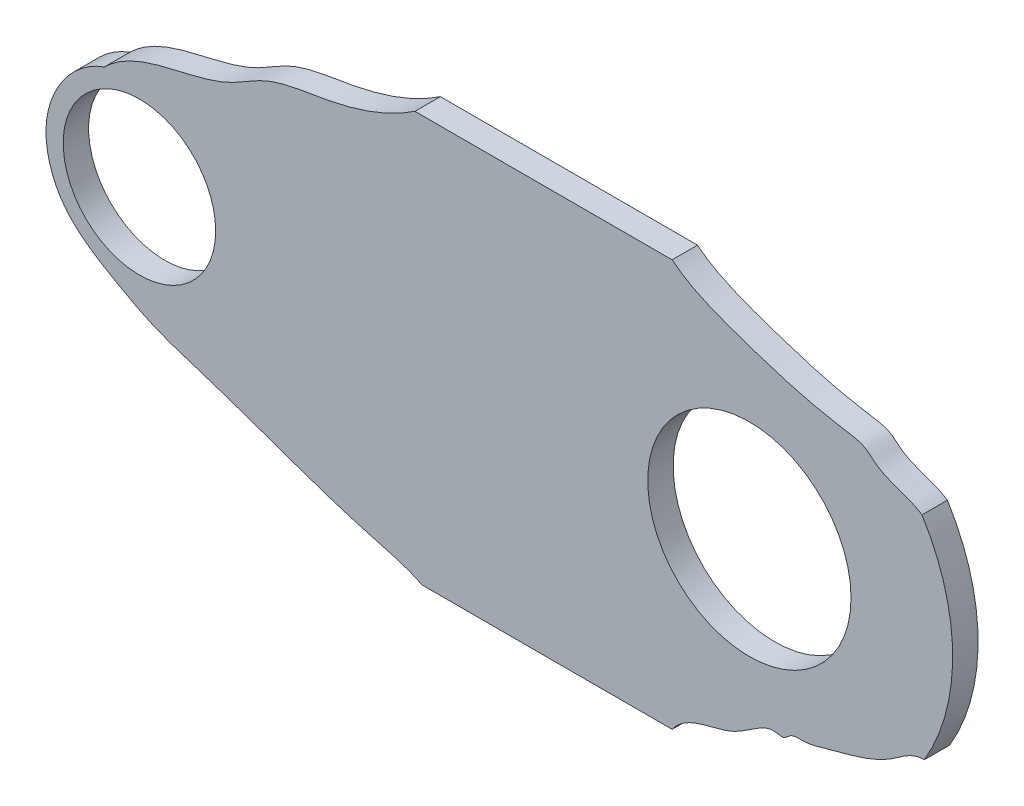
from build123d import *

# Parameters (mm, degrees)
SKETCH1_R           = 9.525
SKETCH1_R_2         = 12.7
BOSS_EXTRUDE1_DEPTH = 1.5875
CUT_EXTRUDE1_REACH  = 115.637


with BuildPart() as part:
    # Sketch1 → Boss-Extrude1 (new, symmetric)
    with BuildSketch(Plane.XY):
        with BuildLine():
            Line((0, 0), (76.2, 0))
            ThreePointArc((76.2, 0), (101.6, -25.4), (76.2, -50.8))
            Line((76.2, -50.8), (0, -50.8))
            ThreePointArc((0, -50.8), (-25.4, -25.4), (0, 0))
        make_face()
        with Locations((0, -25.4)):
            Circle(SKETCH1_R, mode=Mode.SUBTRACT)
        with Locations((76.2, -25.4)):
            Circle(SKETCH1_R_2, mode=Mode.SUBTRACT)
    extrude(amount=BOSS_EXTRUDE1_DEPTH, both=True)

    # Sketch2 → Cut-Extrude1 (cut, up to next)
    with BuildSketch(Plane.XY.offset(1.5875), mode=Mode.PRIVATE) as cut_extrude1_sk1:
        with BuildLine():
            Line((34.42100523, 0), (0, 0))
            ThreePointArc((0, 0), (-25.4, -25.4), (0, -50.8))
            Line((0, -50.8), (35.352786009, -50.8))
            add(Edge.make_bspline(
                [(-4.375837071, -14.592034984), (-8.488463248, -16.067232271), (-13.157608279, -22.767385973), (-10.079239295, -32.925421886), (-3.777509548, -36.687824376), (1.966123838, -39.824108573), (9.049352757, -41.967901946), (17.603585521, -44.997428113), (26.829372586, -48.281871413), (32.857060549, -49.606773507), (35.352786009, -50.8)],
                knots=[0, 0, 0, 0, 0.186565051, 0.294462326, 0.418873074, 0.489089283, 0.577914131, 0.735961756, 0.881001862, 1, 1, 1, 1], degree=3))
            add(Edge.make_bspline(
                [(34.42100523, 0), (31.106815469, -2.238020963), (24.783675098, -4.391580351), (16.372552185, -5.167566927), (8.087062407, -11.050876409), (-0.021865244, -10.287571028), (-4.375837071, -14.592034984)],
                knots=[0, 0, 0, 0, 0.285025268, 0.477252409, 0.592182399, 1, 1, 1, 1], degree=3))
        make_face()
    cut_extrude1_tool1 = extrude(cut_extrude1_sk1.sketch, amount=-CUT_EXTRUDE1_REACH, mode=Mode.PRIVATE) & part.part
    # Sketch2 → Cut-Extrude1 (cut, up to next)
    with BuildSketch(Plane.XY.offset(1.5875), mode=Mode.PRIVATE) as cut_extrude1_sk2:
        with BuildLine():
            Line((66.55151888, 0), (76.2, 0))
            ThreePointArc((76.2, 0), (88.538640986, -3.198244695), (97.770038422, -11.987563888))
            add(Edge.make_bspline(
                [(66.55151888, 0), (68.219046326, -1.384204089), (71.716386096, -2.980388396), (77.346555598, -4.923365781), (82.628036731, -6.581651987), (87.257294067, -7.506866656), (90.452966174, -7.930629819), (93.056770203, -10.514006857), (95.989077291, -10.782773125), (97.770038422, -11.987563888)],
                knots=[0, 0, 0, 0, 0.191374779, 0.33894501, 0.531514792, 0.680444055, 0.766415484, 0.804102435, 1, 1, 1, 1], degree=3))
        make_face()
    cut_extrude1_tool2 = extrude(cut_extrude1_sk2.sketch, amount=-CUT_EXTRUDE1_REACH, mode=Mode.PRIVATE) & part.part
    # Sketch2 → Cut-Extrude1 (cut, up to next)
    with BuildSketch(Plane.XY.offset(1.5875), mode=Mode.PRIVATE) as cut_extrude1_sk3:
        with BuildLine():
            Line((66.55151888, -50.8), (76.2, -50.8))
            ThreePointArc((76.2, -50.8), (88.779324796, -47.46627716), (98.056603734, -38.340203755))
            add(Edge.make_bspline(
                [(66.55151888, -50.8), (68.385111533, -48.206671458), (72.799014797, -48.434329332), (76.652045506, -45.669523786), (78.821539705, -44.34147204), (80.547461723, -44.927138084), (81.461280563, -43.742423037), (83.305201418, -44.010708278), (85.990469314, -43.169510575), (89.740293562, -42.279573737), (94.048385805, -40.598697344), (96.461215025, -38.313074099), (98.056603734, -38.340203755)],
                knots=[0, 0, 0, 0, 0.243553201, 0.339654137, 0.417852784, 0.450838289, 0.478711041, 0.531667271, 0.597471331, 0.726484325, 0.867337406, 1, 1, 1, 1], degree=3))
        make_face()
    cut_extrude1_tool3 = extrude(cut_extrude1_sk3.sketch, amount=-CUT_EXTRUDE1_REACH, mode=Mode.PRIVATE) & part.part
    add(cut_extrude1_tool1.solids().sort_by_distance((17.210503, -0.791931, 1.5875))[0], mode=Mode.SUBTRACT)
    add(cut_extrude1_tool2.solids().sort_by_distance((82.561898, -4.12216, 1.5875))[0], mode=Mode.SUBTRACT)
    add(cut_extrude1_tool3.solids().sort_by_distance((82.822752, -46.383604, 1.5875))[0], mode=Mode.SUBTRACT)


solid = part.part
